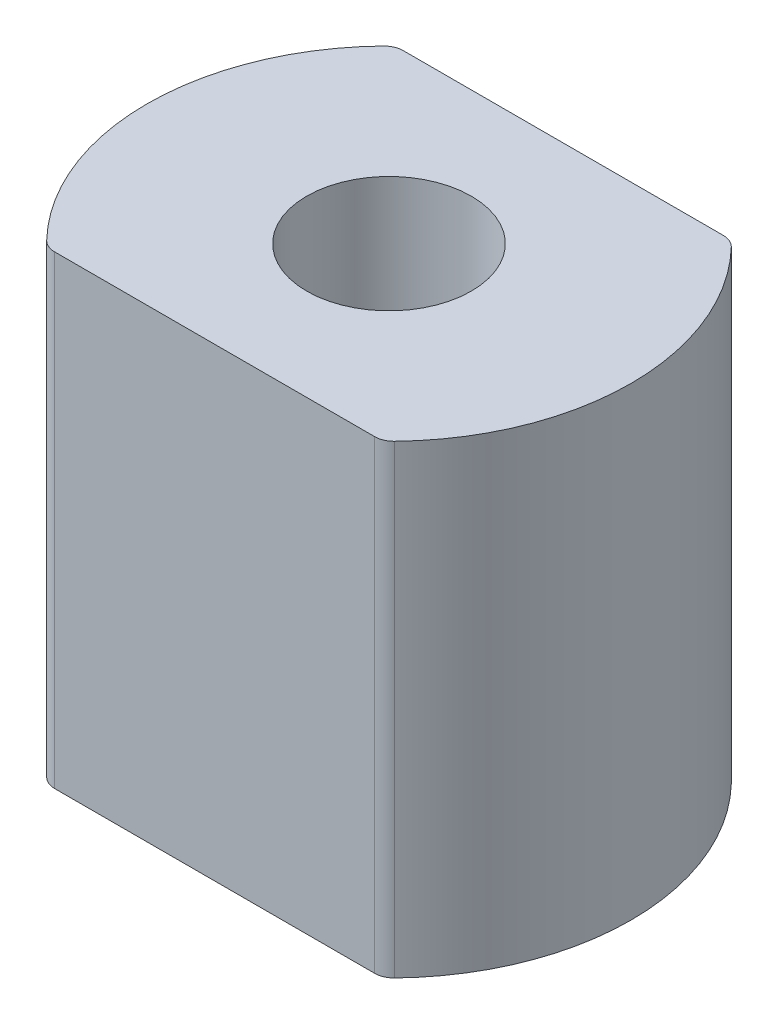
ISO-10303-21;
HEADER;
FILE_DESCRIPTION(('STEP AP214'),'2;1');
FILE_NAME('part.step','',(''),(''),'','','');
FILE_SCHEMA(('AUTOMOTIVE_DESIGN { 1 0 10303 214 1 1 1 1 }'));
ENDSEC;
DATA;
#1=APPLICATION_CONTEXT('core data for automotive mechanical design processes');
#2=APPLICATION_PROTOCOL_DEFINITION('international standard','automotive_design',2000,#1);
#3=PRODUCT_CONTEXT('',#1,'mechanical');
#4=PRODUCT('Part','Part','',(#3));
#5=PRODUCT_RELATED_PRODUCT_CATEGORY('part','',(#4));
#6=PRODUCT_DEFINITION_FORMATION('','',#4);
#7=PRODUCT_DEFINITION_CONTEXT('part definition',#1,'design');
#8=PRODUCT_DEFINITION('design','',#6,#7);
#9=PRODUCT_DEFINITION_SHAPE('','',#8);
#10=(LENGTH_UNIT() NAMED_UNIT(*) SI_UNIT(.MILLI.,.METRE.));
#11=(NAMED_UNIT(*) PLANE_ANGLE_UNIT() SI_UNIT($,.RADIAN.));
#12=(NAMED_UNIT(*) SI_UNIT($,.STERADIAN.) SOLID_ANGLE_UNIT());
#13=UNCERTAINTY_MEASURE_WITH_UNIT(LENGTH_MEASURE(1.E-05),#10,'distance_accuracy_value','');
#14=(GEOMETRIC_REPRESENTATION_CONTEXT(3) GLOBAL_UNCERTAINTY_ASSIGNED_CONTEXT((#13)) GLOBAL_UNIT_ASSIGNED_CONTEXT((#10,
#11,#12)) REPRESENTATION_CONTEXT('',''));
#15=CARTESIAN_POINT('',(0.,0.,0.));
#16=DIRECTION('',(0.,0.,1.));
#17=DIRECTION('',(1.,0.,0.));
#18=AXIS2_PLACEMENT_3D('',#15,#16,#17);
#19=CARTESIAN_POINT('',(0.,12.,0.));
#20=DIRECTION('',(0.,-1.,0.));
#21=DIRECTION('',(0.,0.,-1.));
#22=AXIS2_PLACEMENT_3D('',#19,#20,#21);
#23=CYLINDRICAL_SURFACE('',#22,6.);
#24=CARTESIAN_POINT('',(0.,-12.,0.));
#25=DIRECTION('',(0.,-1.,0.));
#26=DIRECTION('',(0.,0.,-1.));
#27=AXIS2_PLACEMENT_3D('',#24,#25,#26);
#28=CIRCLE('',#27,6.);
#29=CARTESIAN_POINT('',(0.,-12.,-6.));
#30=VERTEX_POINT('',#29);
#31=EDGE_CURVE('P0_E16',#30,#30,#28,.F.);
#32=ORIENTED_EDGE('',*,*,#31,.T.);
#33=EDGE_LOOP('',(#32));
#34=FACE_BOUND('',#33,.T.);
#35=CARTESIAN_POINT('',(0.,12.,0.));
#36=DIRECTION('',(0.,-1.,0.));
#37=DIRECTION('',(0.,0.,-1.));
#38=AXIS2_PLACEMENT_3D('',#35,#36,#37);
#39=CIRCLE('',#38,6.);
#40=CARTESIAN_POINT('',(0.,12.,-6.));
#41=VERTEX_POINT('',#40);
#42=EDGE_CURVE('P0_E10',#41,#41,#39,.T.);
#43=ORIENTED_EDGE('',*,*,#42,.T.);
#44=EDGE_LOOP('',(#43));
#45=FACE_BOUND('',#44,.T.);
#46=ADVANCED_FACE('P0_F15',(#34,#45),#23,.T.);
#47=OPEN_SHELL('',(#46));
#48=SHELL_BASED_SURFACE_MODEL('P0_B1',(#47));
#49=CARTESIAN_POINT('',(8.261355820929,-12.,-8.));
#50=DIRECTION('',(0.,1.,0.));
#51=DIRECTION('',(0.,0.,1.));
#52=AXIS2_PLACEMENT_3D('',#49,#50,#51);
#53=CYLINDRICAL_SURFACE('',#52,1.);
#54=DIRECTION('',(0.,1.,0.));
#55=VECTOR('',#54,1.);
#56=CARTESIAN_POINT('',(8.97973458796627,-12.,-8.69565217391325));
#57=LINE('',#56,#55);
#58=CARTESIAN_POINT('',(8.97973458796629,-12.,-8.69565217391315));
#59=VERTEX_POINT('',#58);
#60=CARTESIAN_POINT('',(8.97973458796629,12.,-8.69565217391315));
#61=VERTEX_POINT('',#60);
#62=EDGE_CURVE('P1_E79',#59,#61,#57,.T.);
#63=ORIENTED_EDGE('',*,*,#62,.F.);
#64=CARTESIAN_POINT('',(8.261355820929,-12.,-8.));
#65=DIRECTION('',(0.,1.,0.));
#66=DIRECTION('',(0.,0.,1.));
#67=AXIS2_PLACEMENT_3D('',#64,#65,#66);
#68=CIRCLE('',#67,1.);
#69=CARTESIAN_POINT('',(8.261355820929,-12.,-9.));
#70=VERTEX_POINT('',#69);
#71=EDGE_CURVE('P1_E84',#59,#70,#68,.T.);
#72=ORIENTED_EDGE('',*,*,#71,.T.);
#73=DIRECTION('',(0.,1.,0.));
#74=VECTOR('',#73,1.);
#75=CARTESIAN_POINT('',(8.261355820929,-12.,-9.));
#76=LINE('',#75,#74);
#77=CARTESIAN_POINT('',(8.261355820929,12.,-9.));
#78=VERTEX_POINT('',#77);
#79=EDGE_CURVE('P1_E82',#78,#70,#76,.F.);
#80=ORIENTED_EDGE('',*,*,#79,.F.);
#81=CARTESIAN_POINT('',(8.261355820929,12.,-8.));
#82=DIRECTION('',(0.,1.,0.));
#83=DIRECTION('',(0.,0.,1.));
#84=AXIS2_PLACEMENT_3D('',#81,#82,#83);
#85=CIRCLE('',#84,1.);
#86=EDGE_CURVE('P1_E20',#78,#61,#85,.F.);
#87=ORIENTED_EDGE('',*,*,#86,.T.);
#88=EDGE_LOOP('',(#63,#72,#80,#87));
#89=FACE_BOUND('',#88,.T.);
#90=ADVANCED_FACE('P1_F17',(#89),#53,.T.);
#91=CARTESIAN_POINT('',(8.261355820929,-12.,8.));
#92=DIRECTION('',(0.,1.,0.));
#93=DIRECTION('',(0.,0.,1.));
#94=AXIS2_PLACEMENT_3D('',#91,#92,#93);
#95=CYLINDRICAL_SURFACE('',#94,1.);
#96=DIRECTION('',(0.,1.,0.));
#97=VECTOR('',#96,1.);
#98=CARTESIAN_POINT('',(8.261355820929,-12.,9.));
#99=LINE('',#98,#97);
#100=CARTESIAN_POINT('',(8.261355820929,-12.,9.));
#101=VERTEX_POINT('',#100);
#102=CARTESIAN_POINT('',(8.261355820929,12.,9.));
#103=VERTEX_POINT('',#102);
#104=EDGE_CURVE('P1_E104',#101,#103,#99,.T.);
#105=ORIENTED_EDGE('',*,*,#104,.F.);
#106=CARTESIAN_POINT('',(8.261355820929,-12.,8.));
#107=DIRECTION('',(0.,1.,0.));
#108=DIRECTION('',(0.,0.,1.));
#109=AXIS2_PLACEMENT_3D('',#106,#107,#108);
#110=CIRCLE('',#109,1.);
#111=CARTESIAN_POINT('',(8.97973458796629,-12.,8.69565217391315));
#112=VERTEX_POINT('',#111);
#113=EDGE_CURVE('P1_E93',#101,#112,#110,.T.);
#114=ORIENTED_EDGE('',*,*,#113,.T.);
#115=DIRECTION('',(0.,1.,0.));
#116=VECTOR('',#115,1.);
#117=CARTESIAN_POINT('',(8.97973458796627,-12.,8.69565217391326));
#118=LINE('',#117,#116);
#119=CARTESIAN_POINT('',(8.97973458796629,12.,8.69565217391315));
#120=VERTEX_POINT('',#119);
#121=EDGE_CURVE('P1_E92',#120,#112,#118,.F.);
#122=ORIENTED_EDGE('',*,*,#121,.F.);
#123=CARTESIAN_POINT('',(8.261355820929,12.,8.));
#124=DIRECTION('',(0.,1.,0.));
#125=DIRECTION('',(0.,0.,1.));
#126=AXIS2_PLACEMENT_3D('',#123,#124,#125);
#127=CIRCLE('',#126,1.);
#128=EDGE_CURVE('P1_E97',#120,#103,#127,.F.);
#129=ORIENTED_EDGE('',*,*,#128,.T.);
#130=EDGE_LOOP('',(#105,#114,#122,#129));
#131=FACE_BOUND('',#130,.T.);
#132=ADVANCED_FACE('P1_F186',(#131),#95,.T.);
#133=CARTESIAN_POINT('',(0.,-12.,0.));
#134=DIRECTION('',(0.,1.,0.));
#135=DIRECTION('',(0.,0.,1.));
#136=AXIS2_PLACEMENT_3D('',#133,#134,#135);
#137=CYLINDRICAL_SURFACE('',#136,12.5);
#138=ORIENTED_EDGE('',*,*,#121,.T.);
#139=CARTESIAN_POINT('',(0.,-12.,0.));
#140=DIRECTION('',(0.,1.,0.));
#141=DIRECTION('',(0.,0.,1.));
#142=AXIS2_PLACEMENT_3D('',#139,#140,#141);
#143=CIRCLE('',#142,12.5);
#144=EDGE_CURVE('P1_E91',#112,#59,#143,.T.);
#145=ORIENTED_EDGE('',*,*,#144,.T.);
#146=ORIENTED_EDGE('',*,*,#62,.T.);
#147=CARTESIAN_POINT('',(0.,12.,0.));
#148=DIRECTION('',(0.,1.,0.));
#149=DIRECTION('',(0.,0.,1.));
#150=AXIS2_PLACEMENT_3D('',#147,#148,#149);
#151=CIRCLE('',#150,12.5);
#152=EDGE_CURVE('P1_E89',#120,#61,#151,.T.);
#153=ORIENTED_EDGE('',*,*,#152,.F.);
#154=EDGE_LOOP('',(#138,#145,#146,#153));
#155=FACE_BOUND('',#154,.T.);
#156=ADVANCED_FACE('P1_F88',(#155),#137,.T.);
#157=CARTESIAN_POINT('',(8.261355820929,-12.,-9.));
#158=DIRECTION('',(0.,0.,-1.));
#159=DIRECTION('',(-1.,0.,0.));
#160=AXIS2_PLACEMENT_3D('',#157,#158,#159);
#161=PLANE('',#160);
#162=ORIENTED_EDGE('',*,*,#79,.T.);
#163=DIRECTION('',(1.,0.,0.));
#164=VECTOR('',#163,1.);
#165=CARTESIAN_POINT('',(0.,-12.,-9.));
#166=LINE('',#165,#164);
#167=CARTESIAN_POINT('',(-8.261355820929,-12.,-9.));
#168=VERTEX_POINT('',#167);
#169=EDGE_CURVE('P1_E116',#70,#168,#166,.F.);
#170=ORIENTED_EDGE('',*,*,#169,.T.);
#171=DIRECTION('',(0.,1.,0.));
#172=VECTOR('',#171,1.);
#173=CARTESIAN_POINT('',(-8.261355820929,-12.,-9.));
#174=LINE('',#173,#172);
#175=CARTESIAN_POINT('',(-8.261355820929,12.,-9.));
#176=VERTEX_POINT('',#175);
#177=EDGE_CURVE('P1_E123',#176,#168,#174,.F.);
#178=ORIENTED_EDGE('',*,*,#177,.F.);
#179=DIRECTION('',(1.,0.,0.));
#180=VECTOR('',#179,1.);
#181=CARTESIAN_POINT('',(0.,12.,-9.));
#182=LINE('',#181,#180);
#183=EDGE_CURVE('P1_E99',#78,#176,#182,.F.);
#184=ORIENTED_EDGE('',*,*,#183,.F.);
#185=EDGE_LOOP('',(#162,#170,#178,#184));
#186=FACE_BOUND('',#185,.T.);
#187=ADVANCED_FACE('P1_F114',(#186),#161,.T.);
#188=CARTESIAN_POINT('',(-8.261355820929,-12.,9.));
#189=DIRECTION('',(0.,0.,1.));
#190=DIRECTION('',(1.,0.,0.));
#191=AXIS2_PLACEMENT_3D('',#188,#189,#190);
#192=PLANE('',#191);
#193=DIRECTION('',(0.,1.,0.));
#194=VECTOR('',#193,1.);
#195=CARTESIAN_POINT('',(-8.261355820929,-12.,9.));
#196=LINE('',#195,#194);
#197=CARTESIAN_POINT('',(-8.261355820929,-12.,9.));
#198=VERTEX_POINT('',#197);
#199=CARTESIAN_POINT('',(-8.261355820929,12.,9.));
#200=VERTEX_POINT('',#199);
#201=EDGE_CURVE('P1_E100',#198,#200,#196,.T.);
#202=ORIENTED_EDGE('',*,*,#201,.F.);
#203=DIRECTION('',(1.,0.,0.));
#204=VECTOR('',#203,1.);
#205=CARTESIAN_POINT('',(0.,-12.,9.));
#206=LINE('',#205,#204);
#207=EDGE_CURVE('P1_E127',#198,#101,#206,.T.);
#208=ORIENTED_EDGE('',*,*,#207,.T.);
#209=ORIENTED_EDGE('',*,*,#104,.T.);
#210=DIRECTION('',(1.,0.,0.));
#211=VECTOR('',#210,1.);
#212=CARTESIAN_POINT('',(0.,12.,9.));
#213=LINE('',#212,#211);
#214=EDGE_CURVE('P1_E135',#200,#103,#213,.T.);
#215=ORIENTED_EDGE('',*,*,#214,.F.);
#216=EDGE_LOOP('',(#202,#208,#209,#215));
#217=FACE_BOUND('',#216,.T.);
#218=ADVANCED_FACE('P1_F158',(#217),#192,.T.);
#219=CARTESIAN_POINT('',(0.,-12.,0.));
#220=DIRECTION('',(0.,1.,0.));
#221=DIRECTION('',(0.,0.,1.));
#222=AXIS2_PLACEMENT_3D('',#219,#220,#221);
#223=CYLINDRICAL_SURFACE('',#222,4.25);
#224=CARTESIAN_POINT('',(0.,12.,0.));
#225=DIRECTION('',(0.,1.,0.));
#226=DIRECTION('',(0.,0.,1.));
#227=AXIS2_PLACEMENT_3D('',#224,#225,#226);
#228=CIRCLE('',#227,4.25);
#229=CARTESIAN_POINT('',(0.,12.,4.25));
#230=VERTEX_POINT('',#229);
#231=EDGE_CURVE('P1_E136',#230,#230,#228,.F.);
#232=ORIENTED_EDGE('',*,*,#231,.F.);
#233=EDGE_LOOP('',(#232));
#234=FACE_BOUND('',#233,.T.);
#235=CARTESIAN_POINT('',(0.,-12.,0.));
#236=DIRECTION('',(0.,1.,0.));
#237=DIRECTION('',(0.,0.,1.));
#238=AXIS2_PLACEMENT_3D('',#235,#236,#237);
#239=CIRCLE('',#238,4.25);
#240=CARTESIAN_POINT('',(0.,-12.,4.25));
#241=VERTEX_POINT('',#240);
#242=EDGE_CURVE('P1_E134',#241,#241,#239,.F.);
#243=ORIENTED_EDGE('',*,*,#242,.T.);
#244=EDGE_LOOP('',(#243));
#245=FACE_BOUND('',#244,.T.);
#246=ADVANCED_FACE('P1_F154',(#234,#245),#223,.F.);
#247=CARTESIAN_POINT('',(-8.261355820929,-12.,8.));
#248=DIRECTION('',(0.,1.,0.));
#249=DIRECTION('',(0.,0.,1.));
#250=AXIS2_PLACEMENT_3D('',#247,#248,#249);
#251=CYLINDRICAL_SURFACE('',#250,1.);
#252=DIRECTION('',(0.,1.,0.));
#253=VECTOR('',#252,1.);
#254=CARTESIAN_POINT('',(-8.97973458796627,-12.,8.69565217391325));
#255=LINE('',#254,#253);
#256=CARTESIAN_POINT('',(-8.97973458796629,-12.,8.69565217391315));
#257=VERTEX_POINT('',#256);
#258=CARTESIAN_POINT('',(-8.97973458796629,12.,8.69565217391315));
#259=VERTEX_POINT('',#258);
#260=EDGE_CURVE('P1_E131',#257,#259,#255,.T.);
#261=ORIENTED_EDGE('',*,*,#260,.F.);
#262=CARTESIAN_POINT('',(-8.261355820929,-12.,8.));
#263=DIRECTION('',(0.,1.,0.));
#264=DIRECTION('',(0.,0.,1.));
#265=AXIS2_PLACEMENT_3D('',#262,#263,#264);
#266=CIRCLE('',#265,1.);
#267=EDGE_CURVE('P1_E121',#257,#198,#266,.T.);
#268=ORIENTED_EDGE('',*,*,#267,.T.);
#269=ORIENTED_EDGE('',*,*,#201,.T.);
#270=CARTESIAN_POINT('',(-8.261355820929,12.,8.));
#271=DIRECTION('',(0.,1.,0.));
#272=DIRECTION('',(0.,0.,1.));
#273=AXIS2_PLACEMENT_3D('',#270,#271,#272);
#274=CIRCLE('',#273,1.);
#275=EDGE_CURVE('P1_E102',#259,#200,#274,.T.);
#276=ORIENTED_EDGE('',*,*,#275,.F.);
#277=EDGE_LOOP('',(#261,#268,#269,#276));
#278=FACE_BOUND('',#277,.T.);
#279=ADVANCED_FACE('P1_F157',(#278),#251,.T.);
#280=CARTESIAN_POINT('',(0.,12.,0.));
#281=DIRECTION('',(0.,1.,0.));
#282=DIRECTION('',(0.,0.,1.));
#283=AXIS2_PLACEMENT_3D('',#280,#281,#282);
#284=PLANE('',#283);
#285=ORIENTED_EDGE('',*,*,#231,.T.);
#286=EDGE_LOOP('',(#285));
#287=FACE_BOUND('',#286,.T.);
#288=ORIENTED_EDGE('',*,*,#214,.T.);
#289=ORIENTED_EDGE('',*,*,#128,.F.);
#290=ORIENTED_EDGE('',*,*,#152,.T.);
#291=ORIENTED_EDGE('',*,*,#86,.F.);
#292=ORIENTED_EDGE('',*,*,#183,.T.);
#293=CARTESIAN_POINT('',(-8.261355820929,12.,-8.));
#294=DIRECTION('',(0.,1.,0.));
#295=DIRECTION('',(0.,0.,1.));
#296=AXIS2_PLACEMENT_3D('',#293,#294,#295);
#297=CIRCLE('',#296,1.);
#298=CARTESIAN_POINT('',(-8.97973458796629,12.,-8.69565217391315));
#299=VERTEX_POINT('',#298);
#300=EDGE_CURVE('P1_E140',#299,#176,#297,.F.);
#301=ORIENTED_EDGE('',*,*,#300,.F.);
#302=CARTESIAN_POINT('',(0.,12.,0.));
#303=DIRECTION('',(0.,1.,0.));
#304=DIRECTION('',(0.,0.,1.));
#305=AXIS2_PLACEMENT_3D('',#302,#303,#304);
#306=CIRCLE('',#305,12.5);
#307=EDGE_CURVE('P1_E130',#259,#299,#306,.F.);
#308=ORIENTED_EDGE('',*,*,#307,.F.);
#309=ORIENTED_EDGE('',*,*,#275,.T.);
#310=EDGE_LOOP('',(#288,#289,#290,#291,#292,#301,#308,#309));
#311=FACE_BOUND('',#310,.T.);
#312=ADVANCED_FACE('P1_F96',(#287,#311),#284,.T.);
#313=CARTESIAN_POINT('',(-8.261355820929,-12.,-8.));
#314=DIRECTION('',(0.,1.,0.));
#315=DIRECTION('',(0.,0.,1.));
#316=AXIS2_PLACEMENT_3D('',#313,#314,#315);
#317=CYLINDRICAL_SURFACE('',#316,1.);
#318=ORIENTED_EDGE('',*,*,#177,.T.);
#319=CARTESIAN_POINT('',(-8.261355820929,-12.,-8.));
#320=DIRECTION('',(0.,1.,0.));
#321=DIRECTION('',(0.,0.,1.));
#322=AXIS2_PLACEMENT_3D('',#319,#320,#321);
#323=CIRCLE('',#322,1.);
#324=CARTESIAN_POINT('',(-8.97973458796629,-12.,-8.69565217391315));
#325=VERTEX_POINT('',#324);
#326=EDGE_CURVE('P1_E35',#168,#325,#323,.T.);
#327=ORIENTED_EDGE('',*,*,#326,.T.);
#328=DIRECTION('',(0.,1.,0.));
#329=VECTOR('',#328,1.);
#330=CARTESIAN_POINT('',(-8.97973458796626,-12.,-8.69565217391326));
#331=LINE('',#330,#329);
#332=EDGE_CURVE('P1_E26',#299,#325,#331,.F.);
#333=ORIENTED_EDGE('',*,*,#332,.F.);
#334=ORIENTED_EDGE('',*,*,#300,.T.);
#335=EDGE_LOOP('',(#318,#327,#333,#334));
#336=FACE_BOUND('',#335,.T.);
#337=ADVANCED_FACE('P1_F164',(#336),#317,.T.);
#338=CARTESIAN_POINT('',(0.,-12.,0.));
#339=DIRECTION('',(0.,1.,0.));
#340=DIRECTION('',(0.,0.,1.));
#341=AXIS2_PLACEMENT_3D('',#338,#339,#340);
#342=PLANE('',#341);
#343=ORIENTED_EDGE('',*,*,#242,.F.);
#344=EDGE_LOOP('',(#343));
#345=FACE_BOUND('',#344,.T.);
#346=ORIENTED_EDGE('',*,*,#267,.F.);
#347=CARTESIAN_POINT('',(0.,-12.,0.));
#348=DIRECTION('',(0.,1.,0.));
#349=DIRECTION('',(0.,0.,1.));
#350=AXIS2_PLACEMENT_3D('',#347,#348,#349);
#351=CIRCLE('',#350,12.5);
#352=EDGE_CURVE('P1_E11',#325,#257,#351,.T.);
#353=ORIENTED_EDGE('',*,*,#352,.F.);
#354=ORIENTED_EDGE('',*,*,#326,.F.);
#355=ORIENTED_EDGE('',*,*,#169,.F.);
#356=ORIENTED_EDGE('',*,*,#71,.F.);
#357=ORIENTED_EDGE('',*,*,#144,.F.);
#358=ORIENTED_EDGE('',*,*,#113,.F.);
#359=ORIENTED_EDGE('',*,*,#207,.F.);
#360=EDGE_LOOP('',(#346,#353,#354,#355,#356,#357,#358,#359));
#361=FACE_BOUND('',#360,.T.);
#362=ADVANCED_FACE('P1_F119',(#345,#361),#342,.F.);
#363=CARTESIAN_POINT('',(0.,-12.,0.));
#364=DIRECTION('',(0.,1.,0.));
#365=DIRECTION('',(0.,0.,1.));
#366=AXIS2_PLACEMENT_3D('',#363,#364,#365);
#367=CYLINDRICAL_SURFACE('',#366,12.5);
#368=ORIENTED_EDGE('',*,*,#332,.T.);
#369=ORIENTED_EDGE('',*,*,#352,.T.);
#370=ORIENTED_EDGE('',*,*,#260,.T.);
#371=ORIENTED_EDGE('',*,*,#307,.T.);
#372=EDGE_LOOP('',(#368,#369,#370,#371));
#373=FACE_BOUND('',#372,.T.);
#374=ADVANCED_FACE('P1_F163',(#373),#367,.T.);
#375=CLOSED_SHELL('',(#90,#132,#156,#187,#218,#246,#279,#312,#337,#362,#374));
#376=MANIFOLD_SOLID_BREP('P1_B1',#375);
#377=ADVANCED_BREP_SHAPE_REPRESENTATION('',(#18,#376),#14);
#378=MANIFOLD_SURFACE_SHAPE_REPRESENTATION('',(#18,#48),#14);
#379=SHAPE_REPRESENTATION('',(#18),#14);
#380=SHAPE_DEFINITION_REPRESENTATION(#9,#379);
#381=SHAPE_REPRESENTATION_RELATIONSHIP('','',#379,#377);
#382=SHAPE_REPRESENTATION_RELATIONSHIP('','',#379,#378);
ENDSEC;
END-ISO-10303-21;
